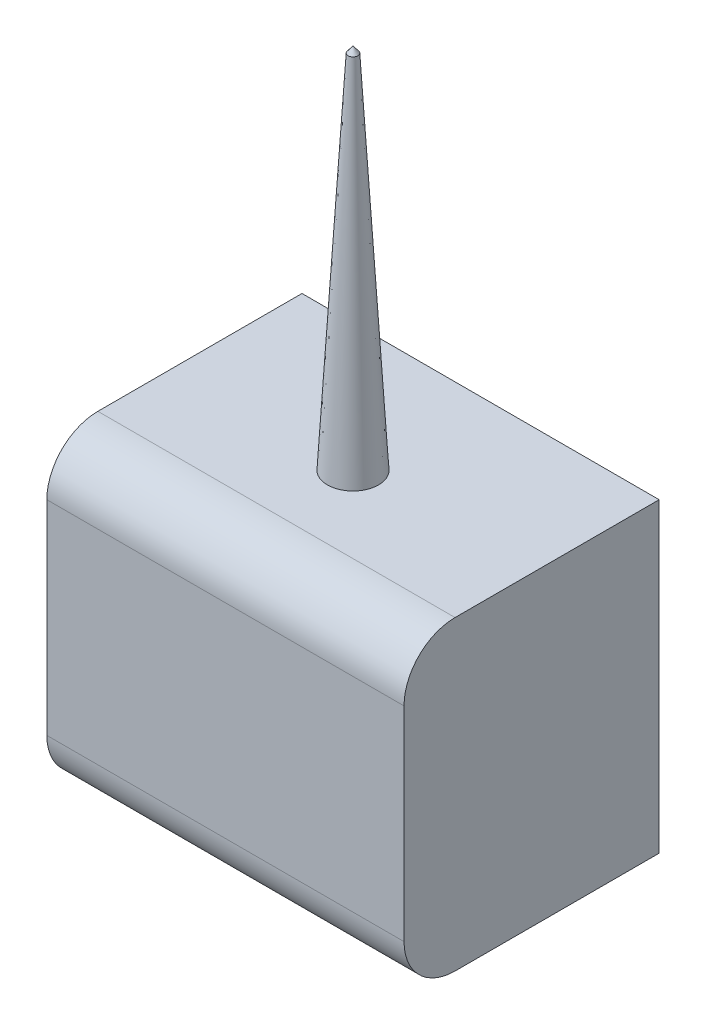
ISO-10303-21;
HEADER;
FILE_DESCRIPTION(('STEP AP214'),'2;1');
FILE_NAME('part.step','',(''),(''),'','','');
FILE_SCHEMA(('AUTOMOTIVE_DESIGN { 1 0 10303 214 1 1 1 1 }'));
ENDSEC;
DATA;
#1=APPLICATION_CONTEXT('core data for automotive mechanical design processes');
#2=APPLICATION_PROTOCOL_DEFINITION('international standard','automotive_design',2000,#1);
#3=PRODUCT_CONTEXT('',#1,'mechanical');
#4=PRODUCT('Part','Part','',(#3));
#5=PRODUCT_RELATED_PRODUCT_CATEGORY('part','',(#4));
#6=PRODUCT_DEFINITION_FORMATION('','',#4);
#7=PRODUCT_DEFINITION_CONTEXT('part definition',#1,'design');
#8=PRODUCT_DEFINITION('design','',#6,#7);
#9=PRODUCT_DEFINITION_SHAPE('','',#8);
#10=(LENGTH_UNIT() NAMED_UNIT(*) SI_UNIT(.MILLI.,.METRE.));
#11=(NAMED_UNIT(*) PLANE_ANGLE_UNIT() SI_UNIT($,.RADIAN.));
#12=(NAMED_UNIT(*) SI_UNIT($,.STERADIAN.) SOLID_ANGLE_UNIT());
#13=UNCERTAINTY_MEASURE_WITH_UNIT(LENGTH_MEASURE(1.E-05),#10,'distance_accuracy_value','');
#14=(GEOMETRIC_REPRESENTATION_CONTEXT(3) GLOBAL_UNCERTAINTY_ASSIGNED_CONTEXT((#13)) GLOBAL_UNIT_ASSIGNED_CONTEXT((#10,
#11,#12)) REPRESENTATION_CONTEXT('',''));
#15=CARTESIAN_POINT('',(0.,0.,0.));
#16=DIRECTION('',(0.,0.,1.));
#17=DIRECTION('',(1.,0.,0.));
#18=AXIS2_PLACEMENT_3D('',#15,#16,#17);
#19=CARTESIAN_POINT('',(0.,60.,50.));
#20=DIRECTION('',(0.,-1.,0.));
#21=DIRECTION('',(0.,0.,-1.));
#22=AXIS2_PLACEMENT_3D('',#19,#20,#21);
#23=PLANE('',#22);
#24=DIRECTION('',(0.,0.,-1.));
#25=VECTOR('',#24,1.);
#26=CARTESIAN_POINT('',(0.,60.,50.));
#27=LINE('',#26,#25);
#28=CARTESIAN_POINT('',(0.,60.,40.));
#29=VERTEX_POINT('',#28);
#30=CARTESIAN_POINT('',(0.,60.,0.));
#31=VERTEX_POINT('',#30);
#32=EDGE_CURVE('E166',#29,#31,#27,.T.);
#33=ORIENTED_EDGE('',*,*,#32,.F.);
#34=DIRECTION('',(-1.,0.,0.));
#35=VECTOR('',#34,1.);
#36=CARTESIAN_POINT('',(0.,60.,40.));
#37=LINE('',#36,#35);
#38=CARTESIAN_POINT('',(70.,60.,40.));
#39=VERTEX_POINT('',#38);
#40=EDGE_CURVE('E39',#29,#39,#37,.F.);
#41=ORIENTED_EDGE('',*,*,#40,.T.);
#42=DIRECTION('',(0.,0.,-1.));
#43=VECTOR('',#42,1.);
#44=CARTESIAN_POINT('',(70.,60.,50.));
#45=LINE('',#44,#43);
#46=CARTESIAN_POINT('',(70.,60.,0.));
#47=VERTEX_POINT('',#46);
#48=EDGE_CURVE('E178',#39,#47,#45,.T.);
#49=ORIENTED_EDGE('',*,*,#48,.T.);
#50=DIRECTION('',(-1.,0.,0.));
#51=VECTOR('',#50,1.);
#52=CARTESIAN_POINT('',(0.,60.,0.));
#53=LINE('',#52,#51);
#54=EDGE_CURVE('E163',#47,#31,#53,.T.);
#55=ORIENTED_EDGE('',*,*,#54,.T.);
#56=EDGE_LOOP('',(#33,#41,#49,#55));
#57=FACE_BOUND('',#56,.T.);
#58=CARTESIAN_POINT('',(35.,60.,25.));
#59=DIRECTION('',(0.,-1.,0.));
#60=DIRECTION('',(0.,0.,-1.));
#61=AXIS2_PLACEMENT_3D('',#58,#59,#60);
#62=CIRCLE('',#61,5.);
#63=CARTESIAN_POINT('',(40.,60.,25.));
#64=VERTEX_POINT('',#63);
#65=EDGE_CURVE('E11',#64,#64,#62,.F.);
#66=ORIENTED_EDGE('',*,*,#65,.F.);
#67=EDGE_LOOP('',(#66));
#68=FACE_BOUND('',#67,.T.);
#69=ADVANCED_FACE('F31',(#57,#68),#23,.F.);
#70=CARTESIAN_POINT('',(0.,0.,50.));
#71=DIRECTION('',(1.,0.,0.));
#72=DIRECTION('',(0.,0.,-1.));
#73=AXIS2_PLACEMENT_3D('',#70,#71,#72);
#74=PLANE('',#73);
#75=DIRECTION('',(0.,0.,-1.));
#76=VECTOR('',#75,1.);
#77=CARTESIAN_POINT('',(0.,0.,50.));
#78=LINE('',#77,#76);
#79=CARTESIAN_POINT('',(0.,0.,40.));
#80=VERTEX_POINT('',#79);
#81=CARTESIAN_POINT('',(0.,0.,0.));
#82=VERTEX_POINT('',#81);
#83=EDGE_CURVE('E183',#80,#82,#78,.T.);
#84=ORIENTED_EDGE('',*,*,#83,.F.);
#85=CARTESIAN_POINT('',(0.,10.,40.));
#86=DIRECTION('',(1.,0.,0.));
#87=DIRECTION('',(0.,0.,-1.));
#88=AXIS2_PLACEMENT_3D('',#85,#86,#87);
#89=CIRCLE('',#88,10.);
#90=CARTESIAN_POINT('',(0.,10.,50.));
#91=VERTEX_POINT('',#90);
#92=EDGE_CURVE('E199',#80,#91,#89,.F.);
#93=ORIENTED_EDGE('',*,*,#92,.T.);
#94=DIRECTION('',(0.,-1.,0.));
#95=VECTOR('',#94,1.);
#96=CARTESIAN_POINT('',(0.,0.,50.));
#97=LINE('',#96,#95);
#98=CARTESIAN_POINT('',(0.,50.,50.));
#99=VERTEX_POINT('',#98);
#100=EDGE_CURVE('E159',#99,#91,#97,.T.);
#101=ORIENTED_EDGE('',*,*,#100,.F.);
#102=CARTESIAN_POINT('',(0.,50.,40.));
#103=DIRECTION('',(1.,0.,0.));
#104=DIRECTION('',(0.,0.,-1.));
#105=AXIS2_PLACEMENT_3D('',#102,#103,#104);
#106=CIRCLE('',#105,10.);
#107=EDGE_CURVE('E197',#99,#29,#106,.F.);
#108=ORIENTED_EDGE('',*,*,#107,.T.);
#109=ORIENTED_EDGE('',*,*,#32,.T.);
#110=DIRECTION('',(0.,-1.,0.));
#111=VECTOR('',#110,1.);
#112=CARTESIAN_POINT('',(0.,0.,0.));
#113=LINE('',#112,#111);
#114=EDGE_CURVE('E158',#31,#82,#113,.T.);
#115=ORIENTED_EDGE('',*,*,#114,.T.);
#116=EDGE_LOOP('',(#84,#93,#101,#108,#109,#115));
#117=FACE_BOUND('',#116,.T.);
#118=ADVANCED_FACE('F219',(#117),#74,.F.);
#119=CARTESIAN_POINT('',(0.,0.,50.));
#120=DIRECTION('',(0.,1.,0.));
#121=DIRECTION('',(0.,0.,1.));
#122=AXIS2_PLACEMENT_3D('',#119,#120,#121);
#123=PLANE('',#122);
#124=DIRECTION('',(1.,0.,0.));
#125=VECTOR('',#124,1.);
#126=CARTESIAN_POINT('',(40.,0.,2.));
#127=LINE('',#126,#125);
#128=CARTESIAN_POINT('',(30.,0.,2.));
#129=VERTEX_POINT('',#128);
#130=CARTESIAN_POINT('',(40.,0.,2.));
#131=VERTEX_POINT('',#130);
#132=EDGE_CURVE('E51',#129,#131,#127,.T.);
#133=ORIENTED_EDGE('',*,*,#132,.T.);
#134=DIRECTION('',(0.,0.,-1.));
#135=VECTOR('',#134,1.);
#136=CARTESIAN_POINT('',(40.,0.,2.));
#137=LINE('',#136,#135);
#138=CARTESIAN_POINT('',(40.,0.,0.));
#139=VERTEX_POINT('',#138);
#140=EDGE_CURVE('E131',#131,#139,#137,.T.);
#141=ORIENTED_EDGE('',*,*,#140,.T.);
#142=DIRECTION('',(1.,0.,0.));
#143=VECTOR('',#142,1.);
#144=CARTESIAN_POINT('',(0.,0.,0.));
#145=LINE('',#144,#143);
#146=CARTESIAN_POINT('',(70.,0.,0.));
#147=VERTEX_POINT('',#146);
#148=EDGE_CURVE('E169',#139,#147,#145,.T.);
#149=ORIENTED_EDGE('',*,*,#148,.T.);
#150=DIRECTION('',(0.,0.,-1.));
#151=VECTOR('',#150,1.);
#152=CARTESIAN_POINT('',(70.,0.,50.));
#153=LINE('',#152,#151);
#154=CARTESIAN_POINT('',(70.,0.,40.));
#155=VERTEX_POINT('',#154);
#156=EDGE_CURVE('E180',#155,#147,#153,.T.);
#157=ORIENTED_EDGE('',*,*,#156,.F.);
#158=DIRECTION('',(1.,0.,0.));
#159=VECTOR('',#158,1.);
#160=CARTESIAN_POINT('',(0.,0.,40.));
#161=LINE('',#160,#159);
#162=EDGE_CURVE('E195',#155,#80,#161,.F.);
#163=ORIENTED_EDGE('',*,*,#162,.T.);
#164=ORIENTED_EDGE('',*,*,#83,.T.);
#165=CARTESIAN_POINT('',(30.,0.,0.));
#166=VERTEX_POINT('',#165);
#167=EDGE_CURVE('E170',#82,#166,#145,.T.);
#168=ORIENTED_EDGE('',*,*,#167,.T.);
#169=DIRECTION('',(0.,0.,-1.));
#170=VECTOR('',#169,1.);
#171=CARTESIAN_POINT('',(30.,0.,2.));
#172=LINE('',#171,#170);
#173=EDGE_CURVE('E46',#129,#166,#172,.T.);
#174=ORIENTED_EDGE('',*,*,#173,.F.);
#175=EDGE_LOOP('',(#133,#141,#149,#157,#163,#164,#168,#174));
#176=FACE_BOUND('',#175,.T.);
#177=ADVANCED_FACE('F225',(#176),#123,.F.);
#178=CARTESIAN_POINT('',(70.,0.,50.));
#179=DIRECTION('',(-1.,0.,0.));
#180=DIRECTION('',(0.,0.,1.));
#181=AXIS2_PLACEMENT_3D('',#178,#179,#180);
#182=PLANE('',#181);
#183=DIRECTION('',(0.,1.,0.));
#184=VECTOR('',#183,1.);
#185=CARTESIAN_POINT('',(70.,0.,50.));
#186=LINE('',#185,#184);
#187=CARTESIAN_POINT('',(70.,10.,50.));
#188=VERTEX_POINT('',#187);
#189=CARTESIAN_POINT('',(70.,50.,50.));
#190=VERTEX_POINT('',#189);
#191=EDGE_CURVE('E162',#188,#190,#186,.T.);
#192=ORIENTED_EDGE('',*,*,#191,.F.);
#193=CARTESIAN_POINT('',(70.,10.,40.));
#194=DIRECTION('',(-1.,0.,0.));
#195=DIRECTION('',(0.,0.,1.));
#196=AXIS2_PLACEMENT_3D('',#193,#194,#195);
#197=CIRCLE('',#196,10.);
#198=EDGE_CURVE('E193',#188,#155,#197,.F.);
#199=ORIENTED_EDGE('',*,*,#198,.T.);
#200=ORIENTED_EDGE('',*,*,#156,.T.);
#201=DIRECTION('',(0.,1.,0.));
#202=VECTOR('',#201,1.);
#203=CARTESIAN_POINT('',(70.,0.,0.));
#204=LINE('',#203,#202);
#205=EDGE_CURVE('E172',#147,#47,#204,.T.);
#206=ORIENTED_EDGE('',*,*,#205,.T.);
#207=ORIENTED_EDGE('',*,*,#48,.F.);
#208=CARTESIAN_POINT('',(70.,50.,40.));
#209=DIRECTION('',(-1.,0.,0.));
#210=DIRECTION('',(0.,0.,1.));
#211=AXIS2_PLACEMENT_3D('',#208,#209,#210);
#212=CIRCLE('',#211,10.);
#213=EDGE_CURVE('E191',#39,#190,#212,.F.);
#214=ORIENTED_EDGE('',*,*,#213,.T.);
#215=EDGE_LOOP('',(#192,#199,#200,#206,#207,#214));
#216=FACE_BOUND('',#215,.T.);
#217=ADVANCED_FACE('F209',(#216),#182,.F.);
#218=CARTESIAN_POINT('',(0.,60.,50.));
#219=DIRECTION('',(0.,0.,-1.));
#220=DIRECTION('',(-1.,0.,0.));
#221=AXIS2_PLACEMENT_3D('',#218,#219,#220);
#222=PLANE('',#221);
#223=ORIENTED_EDGE('',*,*,#100,.T.);
#224=DIRECTION('',(1.,0.,0.));
#225=VECTOR('',#224,1.);
#226=CARTESIAN_POINT('',(0.,10.,50.));
#227=LINE('',#226,#225);
#228=EDGE_CURVE('E188',#91,#188,#227,.T.);
#229=ORIENTED_EDGE('',*,*,#228,.T.);
#230=ORIENTED_EDGE('',*,*,#191,.T.);
#231=DIRECTION('',(-1.,0.,0.));
#232=VECTOR('',#231,1.);
#233=CARTESIAN_POINT('',(0.,50.,50.));
#234=LINE('',#233,#232);
#235=EDGE_CURVE('E185',#190,#99,#234,.T.);
#236=ORIENTED_EDGE('',*,*,#235,.T.);
#237=EDGE_LOOP('',(#223,#229,#230,#236));
#238=FACE_BOUND('',#237,.T.);
#239=ADVANCED_FACE('F215',(#238),#222,.F.);
#240=CARTESIAN_POINT('',(0.,60.,0.));
#241=DIRECTION('',(0.,0.,-1.));
#242=DIRECTION('',(-1.,0.,0.));
#243=AXIS2_PLACEMENT_3D('',#240,#241,#242);
#244=PLANE('',#243);
#245=CARTESIAN_POINT('',(35.,53.,0.));
#246=DIRECTION('',(0.,0.,-1.));
#247=DIRECTION('',(-1.,0.,0.));
#248=AXIS2_PLACEMENT_3D('',#245,#246,#247);
#249=CIRCLE('',#248,2.5);
#250=CARTESIAN_POINT('',(32.5,53.,0.));
#251=VERTEX_POINT('',#250);
#252=EDGE_CURVE('E147',#251,#251,#249,.T.);
#253=ORIENTED_EDGE('',*,*,#252,.F.);
#254=EDGE_LOOP('',(#253));
#255=FACE_BOUND('',#254,.T.);
#256=ORIENTED_EDGE('',*,*,#114,.F.);
#257=ORIENTED_EDGE('',*,*,#54,.F.);
#258=ORIENTED_EDGE('',*,*,#205,.F.);
#259=ORIENTED_EDGE('',*,*,#148,.F.);
#260=DIRECTION('',(0.,-1.,0.));
#261=VECTOR('',#260,1.);
#262=CARTESIAN_POINT('',(40.,0.,0.));
#263=LINE('',#262,#261);
#264=CARTESIAN_POINT('',(40.,-9.99999999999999,0.));
#265=VERTEX_POINT('',#264);
#266=EDGE_CURVE('E142',#139,#265,#263,.T.);
#267=ORIENTED_EDGE('',*,*,#266,.T.);
#268=DIRECTION('',(-1.,0.,0.));
#269=VECTOR('',#268,1.);
#270=CARTESIAN_POINT('',(40.,-9.99999999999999,0.));
#271=LINE('',#270,#269);
#272=CARTESIAN_POINT('',(30.,-9.99999999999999,0.));
#273=VERTEX_POINT('',#272);
#274=EDGE_CURVE('E116',#265,#273,#271,.T.);
#275=ORIENTED_EDGE('',*,*,#274,.T.);
#276=DIRECTION('',(0.,1.,0.));
#277=VECTOR('',#276,1.);
#278=CARTESIAN_POINT('',(30.,0.,0.));
#279=LINE('',#278,#277);
#280=EDGE_CURVE('E132',#273,#166,#279,.T.);
#281=ORIENTED_EDGE('',*,*,#280,.T.);
#282=ORIENTED_EDGE('',*,*,#167,.F.);
#283=EDGE_LOOP('',(#256,#257,#258,#259,#267,#275,#281,#282));
#284=FACE_BOUND('',#283,.T.);
#285=CARTESIAN_POINT('',(35.,-6.50000000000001,0.));
#286=DIRECTION('',(0.,0.,-1.));
#287=DIRECTION('',(-1.,0.,0.));
#288=AXIS2_PLACEMENT_3D('',#285,#286,#287);
#289=CIRCLE('',#288,2.5);
#290=CARTESIAN_POINT('',(32.5,-6.50000000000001,0.));
#291=VERTEX_POINT('',#290);
#292=EDGE_CURVE('E137',#291,#291,#289,.T.);
#293=ORIENTED_EDGE('',*,*,#292,.F.);
#294=EDGE_LOOP('',(#293));
#295=FACE_BOUND('',#294,.T.);
#296=ADVANCED_FACE('F228',(#255,#284,#295),#244,.T.);
#297=CARTESIAN_POINT('',(0.,10.,40.));
#298=DIRECTION('',(1.,0.,0.));
#299=DIRECTION('',(0.,0.,-1.));
#300=AXIS2_PLACEMENT_3D('',#297,#298,#299);
#301=CYLINDRICAL_SURFACE('',#300,10.);
#302=ORIENTED_EDGE('',*,*,#92,.F.);
#303=ORIENTED_EDGE('',*,*,#162,.F.);
#304=ORIENTED_EDGE('',*,*,#198,.F.);
#305=ORIENTED_EDGE('',*,*,#228,.F.);
#306=EDGE_LOOP('',(#302,#303,#304,#305));
#307=FACE_BOUND('',#306,.T.);
#308=ADVANCED_FACE('F223',(#307),#301,.T.);
#309=CARTESIAN_POINT('',(0.,50.,40.));
#310=DIRECTION('',(-1.,0.,0.));
#311=DIRECTION('',(0.,0.,1.));
#312=AXIS2_PLACEMENT_3D('',#309,#310,#311);
#313=CYLINDRICAL_SURFACE('',#312,10.);
#314=ORIENTED_EDGE('',*,*,#213,.F.);
#315=ORIENTED_EDGE('',*,*,#40,.F.);
#316=ORIENTED_EDGE('',*,*,#107,.F.);
#317=ORIENTED_EDGE('',*,*,#235,.F.);
#318=EDGE_LOOP('',(#314,#315,#316,#317));
#319=FACE_BOUND('',#318,.T.);
#320=ADVANCED_FACE('F33',(#319),#313,.T.);
#321=CARTESIAN_POINT('',(35.,130.815077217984,25.));
#322=DIRECTION('',(0.,-1.,0.));
#323=DIRECTION('',(1.,0.,0.));
#324=AXIS2_PLACEMENT_3D('',#321,#322,#323);
#325=CONICAL_SURFACE('',#324,0.942886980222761,0.0572290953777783);
#326=CARTESIAN_POINT('',(35.,130.815077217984,25.));
#327=DIRECTION('',(0.,-1.,0.));
#328=DIRECTION('',(1.,0.,0.));
#329=AXIS2_PLACEMENT_3D('',#326,#327,#328);
#330=CIRCLE('',#329,0.942886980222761);
#331=CARTESIAN_POINT('',(35.9428869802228,130.815077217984,25.));
#332=VERTEX_POINT('',#331);
#333=EDGE_CURVE('E153',#332,#332,#330,.T.);
#334=CARTESIAN_POINT('',(40.,60.,25.));
#335=CARTESIAN_POINT('',(39.957738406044,60.737657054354,25.));
#336=CARTESIAN_POINT('',(39.915476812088,61.475314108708,25.));
#337=CARTESIAN_POINT('',(39.830953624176,62.950628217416,25.));
#338=CARTESIAN_POINT('',(39.7886920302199,63.68828527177,25.));
#339=CARTESIAN_POINT('',(39.7041688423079,65.163599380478,25.));
#340=CARTESIAN_POINT('',(39.6619072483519,65.901256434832,25.));
#341=CARTESIAN_POINT('',(39.5773840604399,67.37657054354,25.));
#342=CARTESIAN_POINT('',(39.5351224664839,68.114227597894,25.));
#343=CARTESIAN_POINT('',(39.4505992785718,69.589541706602,25.));
#344=CARTESIAN_POINT('',(39.4083376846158,70.327198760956,25.));
#345=CARTESIAN_POINT('',(39.3238144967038,71.802512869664,25.));
#346=CARTESIAN_POINT('',(39.2815529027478,72.540169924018,25.));
#347=CARTESIAN_POINT('',(39.1970297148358,74.015484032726,25.));
#348=CARTESIAN_POINT('',(39.1547681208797,74.75314108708,25.));
#349=CARTESIAN_POINT('',(39.0702449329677,76.228455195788,25.));
#350=CARTESIAN_POINT('',(39.0279833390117,76.966112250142,25.));
#351=CARTESIAN_POINT('',(38.9434601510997,78.44142635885,25.));
#352=CARTESIAN_POINT('',(38.9011985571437,79.179083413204,25.));
#353=CARTESIAN_POINT('',(38.8166753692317,80.654397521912,25.));
#354=CARTESIAN_POINT('',(38.7744137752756,81.392054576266,25.));
#355=CARTESIAN_POINT('',(38.6898905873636,82.867368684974,25.));
#356=CARTESIAN_POINT('',(38.6476289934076,83.605025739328,25.));
#357=CARTESIAN_POINT('',(38.5631058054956,85.0803398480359,25.));
#358=CARTESIAN_POINT('',(38.5208442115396,85.81799690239,25.));
#359=CARTESIAN_POINT('',(38.4363210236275,87.293311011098,25.));
#360=CARTESIAN_POINT('',(38.3940594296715,88.030968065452,25.));
#361=CARTESIAN_POINT('',(38.3095362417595,89.50628217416,25.));
#362=CARTESIAN_POINT('',(38.2672746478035,90.243939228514,25.));
#363=CARTESIAN_POINT('',(38.1827514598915,91.7192533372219,25.));
#364=CARTESIAN_POINT('',(38.1404898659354,92.456910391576,25.));
#365=CARTESIAN_POINT('',(38.0559666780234,93.932224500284,25.));
#366=CARTESIAN_POINT('',(38.0137050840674,94.669881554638,25.));
#367=CARTESIAN_POINT('',(37.9291818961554,96.1451956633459,25.));
#368=CARTESIAN_POINT('',(37.8869203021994,96.8828527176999,25.));
#369=CARTESIAN_POINT('',(37.8023971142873,98.3581668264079,25.));
#370=CARTESIAN_POINT('',(37.7601355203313,99.0958238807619,25.));
#371=CARTESIAN_POINT('',(37.6756123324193,100.57113798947,25.));
#372=CARTESIAN_POINT('',(37.6333507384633,101.308795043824,25.));
#373=CARTESIAN_POINT('',(37.5488275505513,102.784109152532,25.));
#374=CARTESIAN_POINT('',(37.5065659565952,103.521766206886,25.));
#375=CARTESIAN_POINT('',(37.4220427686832,104.997080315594,25.));
#376=CARTESIAN_POINT('',(37.3797811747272,105.734737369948,25.));
#377=CARTESIAN_POINT('',(37.2952579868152,107.210051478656,25.));
#378=CARTESIAN_POINT('',(37.2529963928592,107.94770853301,25.));
#379=CARTESIAN_POINT('',(37.1684732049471,109.423022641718,25.));
#380=CARTESIAN_POINT('',(37.1262116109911,110.160679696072,25.));
#381=CARTESIAN_POINT('',(37.0416884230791,111.63599380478,25.));
#382=CARTESIAN_POINT('',(36.9994268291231,112.373650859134,25.));
#383=CARTESIAN_POINT('',(36.9149036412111,113.848964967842,25.));
#384=CARTESIAN_POINT('',(36.872642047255,114.586622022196,25.));
#385=CARTESIAN_POINT('',(36.788118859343,116.061936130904,25.));
#386=CARTESIAN_POINT('',(36.745857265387,116.799593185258,25.));
#387=CARTESIAN_POINT('',(36.661334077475,118.274907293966,25.));
#388=CARTESIAN_POINT('',(36.619072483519,119.01256434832,25.));
#389=CARTESIAN_POINT('',(36.534549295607,120.487878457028,25.));
#390=CARTESIAN_POINT('',(36.4922877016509,121.225535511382,25.));
#391=CARTESIAN_POINT('',(36.4077645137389,122.70084962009,25.));
#392=CARTESIAN_POINT('',(36.3655029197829,123.438506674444,25.));
#393=CARTESIAN_POINT('',(36.2809797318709,124.913820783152,25.));
#394=CARTESIAN_POINT('',(36.2387181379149,125.651477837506,25.));
#395=CARTESIAN_POINT('',(36.1541949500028,127.126791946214,25.));
#396=CARTESIAN_POINT('',(36.1119333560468,127.864449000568,25.));
#397=CARTESIAN_POINT('',(36.0274101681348,129.339763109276,25.));
#398=CARTESIAN_POINT('',(35.9851485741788,130.07742016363,25.));
#399=CARTESIAN_POINT('',(35.9428869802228,130.815077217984,25.));
#400=B_SPLINE_CURVE_WITH_KNOTS('',3,(#334,#335,#336,#337,#338,#339,#340,#341,#342,#343,#344,
#345,#346,#347,#348,#349,#350,#351,#352,#353,#354,#355,#356,#357,#358,#359,#360,#361,#362,#363,
#364,#365,#366,#367,#368,#369,#370,#371,#372,#373,#374,#375,#376,#377,#378,#379,#380,#381,#382,
#383,#384,#385,#386,#387,#388,#389,#390,#391,#392,#393,#394,#395,#396,#397,#398,#399),
.UNSPECIFIED.,.F.,.F.,(4,2,2,2,2,2,2,2,2,2,2,2,2,2,2,2,2,2,2,2,2,2,2,2,2,2,2,2,2,2,2,2,4),(0.,
2.21660004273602,4.43320008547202,6.64980012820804,8.86640017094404,11.0830002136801,
13.2996002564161,15.5162002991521,17.7328003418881,19.9494003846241,22.1660004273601,
24.3826004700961,26.5992005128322,28.8158005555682,31.0324005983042,33.2490006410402,
35.4656006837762,37.6822007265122,39.8988007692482,42.1154008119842,44.3320008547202,
46.5486008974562,48.7652009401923,50.9818009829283,53.1984010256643,55.4150010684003,
57.6316011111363,59.8482011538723,62.0648011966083,64.2814012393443,66.4980012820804,
68.7146013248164,70.9312013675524),.UNSPECIFIED.);
#401=EDGE_CURVE('BSEAM261',#64,#332,#400,.T.);
#402=ORIENTED_EDGE('',*,*,#65,.T.);
#403=ORIENTED_EDGE('',*,*,#333,.T.);
#404=ORIENTED_EDGE('',*,*,#401,.T.);
#405=ORIENTED_EDGE('',*,*,#401,.F.);
#406=EDGE_LOOP('',(#402,#404,#403,#405));
#407=FACE_BOUND('',#406,.T.);
#408=ADVANCED_FACE('F261',(#407),#325,.T.);
#409=CARTESIAN_POINT('',(35.,132.,25.));
#410=DIRECTION('',(0.,-1.,0.));
#411=DIRECTION('',(1.,0.,0.));
#412=AXIS2_PLACEMENT_3D('',#409,#410,#411);
#413=CONICAL_SURFACE('',#412,0.,0.672136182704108);
#414=ORIENTED_EDGE('',*,*,#333,.F.);
#415=EDGE_LOOP('',(#414));
#416=FACE_BOUND('',#415,.T.);
#417=CARTESIAN_POINT('',(35.,132.,25.));
#418=VERTEX_POINT('',#417);
#419=VERTEX_LOOP('',#418);
#420=FACE_BOUND('',#419,.T.);
#421=ADVANCED_FACE('F270',(#416,#420),#413,.T.);
#422=CARTESIAN_POINT('',(35.,53.,2.));
#423=DIRECTION('',(0.,0.,-1.));
#424=DIRECTION('',(-1.,0.,0.));
#425=AXIS2_PLACEMENT_3D('',#422,#423,#424);
#426=CYLINDRICAL_SURFACE('',#425,2.5);
#427=CARTESIAN_POINT('',(35.,53.,2.));
#428=DIRECTION('',(0.,0.,-1.));
#429=DIRECTION('',(-1.,0.,0.));
#430=AXIS2_PLACEMENT_3D('',#427,#428,#429);
#431=CIRCLE('',#430,2.5);
#432=CARTESIAN_POINT('',(32.5,53.,2.));
#433=VERTEX_POINT('',#432);
#434=EDGE_CURVE('E150',#433,#433,#431,.T.);
#435=ORIENTED_EDGE('',*,*,#434,.F.);
#436=EDGE_LOOP('',(#435));
#437=FACE_BOUND('',#436,.T.);
#438=ORIENTED_EDGE('',*,*,#252,.T.);
#439=EDGE_LOOP('',(#438));
#440=FACE_BOUND('',#439,.T.);
#441=ADVANCED_FACE('F268',(#437,#440),#426,.F.);
#442=CARTESIAN_POINT('',(35.,53.,2.));
#443=DIRECTION('',(0.,0.,-1.));
#444=DIRECTION('',(-1.,0.,0.));
#445=AXIS2_PLACEMENT_3D('',#442,#443,#444);
#446=PLANE('',#445);
#447=ORIENTED_EDGE('',*,*,#434,.T.);
#448=EDGE_LOOP('',(#447));
#449=FACE_BOUND('',#448,.T.);
#450=ADVANCED_FACE('F241',(#449),#446,.T.);
#451=CARTESIAN_POINT('',(40.,0.,2.));
#452=DIRECTION('',(1.,0.,0.));
#453=DIRECTION('',(0.,0.,-1.));
#454=AXIS2_PLACEMENT_3D('',#451,#452,#453);
#455=PLANE('',#454);
#456=ORIENTED_EDGE('',*,*,#266,.F.);
#457=ORIENTED_EDGE('',*,*,#140,.F.);
#458=DIRECTION('',(0.,-1.,0.));
#459=VECTOR('',#458,1.);
#460=CARTESIAN_POINT('',(40.,0.,2.));
#461=LINE('',#460,#459);
#462=CARTESIAN_POINT('',(40.,-9.99999999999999,2.));
#463=VERTEX_POINT('',#462);
#464=EDGE_CURVE('E127',#131,#463,#461,.T.);
#465=ORIENTED_EDGE('',*,*,#464,.T.);
#466=DIRECTION('',(0.,0.,-1.));
#467=VECTOR('',#466,1.);
#468=CARTESIAN_POINT('',(40.,-9.99999999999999,2.));
#469=LINE('',#468,#467);
#470=EDGE_CURVE('E111',#463,#265,#469,.T.);
#471=ORIENTED_EDGE('',*,*,#470,.T.);
#472=EDGE_LOOP('',(#456,#457,#465,#471));
#473=FACE_BOUND('',#472,.T.);
#474=ADVANCED_FACE('F130',(#473),#455,.T.);
#475=CARTESIAN_POINT('',(30.,0.,2.));
#476=DIRECTION('',(-1.,0.,0.));
#477=DIRECTION('',(0.,0.,1.));
#478=AXIS2_PLACEMENT_3D('',#475,#476,#477);
#479=PLANE('',#478);
#480=ORIENTED_EDGE('',*,*,#280,.F.);
#481=DIRECTION('',(0.,0.,-1.));
#482=VECTOR('',#481,1.);
#483=CARTESIAN_POINT('',(30.,-9.99999999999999,2.));
#484=LINE('',#483,#482);
#485=CARTESIAN_POINT('',(30.,-9.99999999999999,2.));
#486=VERTEX_POINT('',#485);
#487=EDGE_CURVE('E121',#486,#273,#484,.T.);
#488=ORIENTED_EDGE('',*,*,#487,.F.);
#489=DIRECTION('',(0.,1.,0.));
#490=VECTOR('',#489,1.);
#491=CARTESIAN_POINT('',(30.,0.,2.));
#492=LINE('',#491,#490);
#493=EDGE_CURVE('E128',#486,#129,#492,.T.);
#494=ORIENTED_EDGE('',*,*,#493,.T.);
#495=ORIENTED_EDGE('',*,*,#173,.T.);
#496=EDGE_LOOP('',(#480,#488,#494,#495));
#497=FACE_BOUND('',#496,.T.);
#498=ADVANCED_FACE('F233',(#497),#479,.T.);
#499=CARTESIAN_POINT('',(40.,-9.99999999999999,2.));
#500=DIRECTION('',(0.,-1.,0.));
#501=DIRECTION('',(0.,0.,-1.));
#502=AXIS2_PLACEMENT_3D('',#499,#500,#501);
#503=PLANE('',#502);
#504=ORIENTED_EDGE('',*,*,#274,.F.);
#505=ORIENTED_EDGE('',*,*,#470,.F.);
#506=DIRECTION('',(-1.,0.,0.));
#507=VECTOR('',#506,1.);
#508=CARTESIAN_POINT('',(40.,-9.99999999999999,2.));
#509=LINE('',#508,#507);
#510=EDGE_CURVE('E114',#463,#486,#509,.T.);
#511=ORIENTED_EDGE('',*,*,#510,.T.);
#512=ORIENTED_EDGE('',*,*,#487,.T.);
#513=EDGE_LOOP('',(#504,#505,#511,#512));
#514=FACE_BOUND('',#513,.T.);
#515=ADVANCED_FACE('F113',(#514),#503,.T.);
#516=CARTESIAN_POINT('',(40.,-9.99999999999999,2.));
#517=DIRECTION('',(0.,0.,-1.));
#518=DIRECTION('',(-1.,0.,0.));
#519=AXIS2_PLACEMENT_3D('',#516,#517,#518);
#520=PLANE('',#519);
#521=CARTESIAN_POINT('',(35.,-6.50000000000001,2.));
#522=DIRECTION('',(0.,0.,-1.));
#523=DIRECTION('',(-1.,0.,0.));
#524=AXIS2_PLACEMENT_3D('',#521,#522,#523);
#525=CIRCLE('',#524,2.5);
#526=CARTESIAN_POINT('',(32.5,-6.50000000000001,2.));
#527=VERTEX_POINT('',#526);
#528=EDGE_CURVE('E144',#527,#527,#525,.T.);
#529=ORIENTED_EDGE('',*,*,#528,.T.);
#530=EDGE_LOOP('',(#529));
#531=FACE_BOUND('',#530,.T.);
#532=ORIENTED_EDGE('',*,*,#464,.F.);
#533=ORIENTED_EDGE('',*,*,#132,.F.);
#534=ORIENTED_EDGE('',*,*,#493,.F.);
#535=ORIENTED_EDGE('',*,*,#510,.F.);
#536=EDGE_LOOP('',(#532,#533,#534,#535));
#537=FACE_BOUND('',#536,.T.);
#538=ADVANCED_FACE('F126',(#531,#537),#520,.F.);
#539=CARTESIAN_POINT('',(35.,-6.50000000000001,2.));
#540=DIRECTION('',(0.,0.,-1.));
#541=DIRECTION('',(-1.,0.,0.));
#542=AXIS2_PLACEMENT_3D('',#539,#540,#541);
#543=CYLINDRICAL_SURFACE('',#542,2.5);
#544=ORIENTED_EDGE('',*,*,#528,.F.);
#545=EDGE_LOOP('',(#544));
#546=FACE_BOUND('',#545,.T.);
#547=ORIENTED_EDGE('',*,*,#292,.T.);
#548=EDGE_LOOP('',(#547));
#549=FACE_BOUND('',#548,.T.);
#550=ADVANCED_FACE('F345',(#546,#549),#543,.F.);
#551=CLOSED_SHELL('',(#69,#118,#177,#217,#239,#296,#308,#320,#408,#421,#441,#450,#474,#498,#515,
#538,#550));
#552=MANIFOLD_SOLID_BREP('B2',#551);
#553=ADVANCED_BREP_SHAPE_REPRESENTATION('',(#18,#552),#14);
#554=SHAPE_DEFINITION_REPRESENTATION(#9,#553);
ENDSEC;
END-ISO-10303-21;
